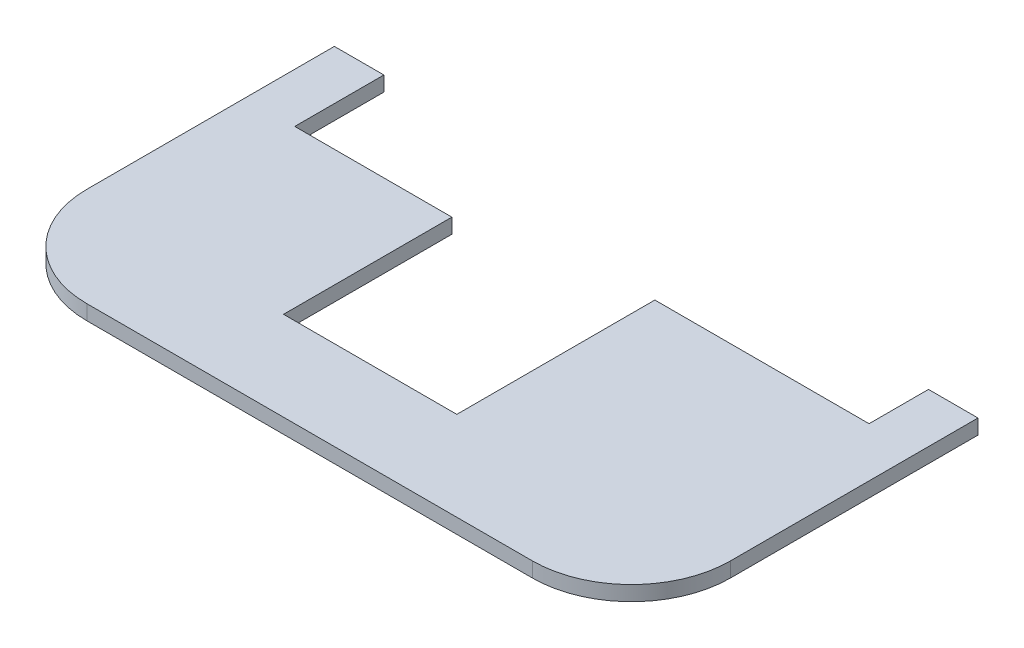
from build123d import *

# Parameters (mm, degrees)
BOSS_EXTRUDE1_DEPTH     = 3
CUT_EXTRUDE1_DEPTH      = 148.678705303
CUT_EXTRUDE1_DEPTH_BACK = 148.678705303


with BuildPart() as part:
    # Sketch1 → Boss-Extrude1 (new body)
    with BuildSketch(Plane(origin=(0, 0, 0), x_dir=(1, 0, 0), z_dir=(0, 1, 0))):
        with BuildLine():
            Line((20, 0), (110, 0))
            ThreePointArc((110, 0), (124.142135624, 5.857864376), (130, 20))
            Line((130, 20), (130, 70))
            Line((130, 70), (0, 70))
            Line((0, 70), (0, 20))
            ThreePointArc((0, 20), (5.857864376, 5.857864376), (20, 0))
        make_face()
    extrude(amount=BOSS_EXTRUDE1_DEPTH)

    # Sketch2 → Cut-Extrude1 (cut, two sides: drawn at the far end of the back side and taken through both)
    with BuildSketch(Plane(origin=(0, 3, 0), x_dir=(1, 0, 0), z_dir=(0, 1, 0)).offset(-CUT_EXTRUDE1_DEPTH_BACK)):
        Polygon((10, 70), (120, 70), (120, 58), (76.731661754, 58), (76.731661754, 18), (41.731661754, 18), (41.731661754, 52), (10, 52), (10, 58), align=None)
    extrude(amount=CUT_EXTRUDE1_DEPTH + CUT_EXTRUDE1_DEPTH_BACK, mode=Mode.SUBTRACT)


solid = part.part
